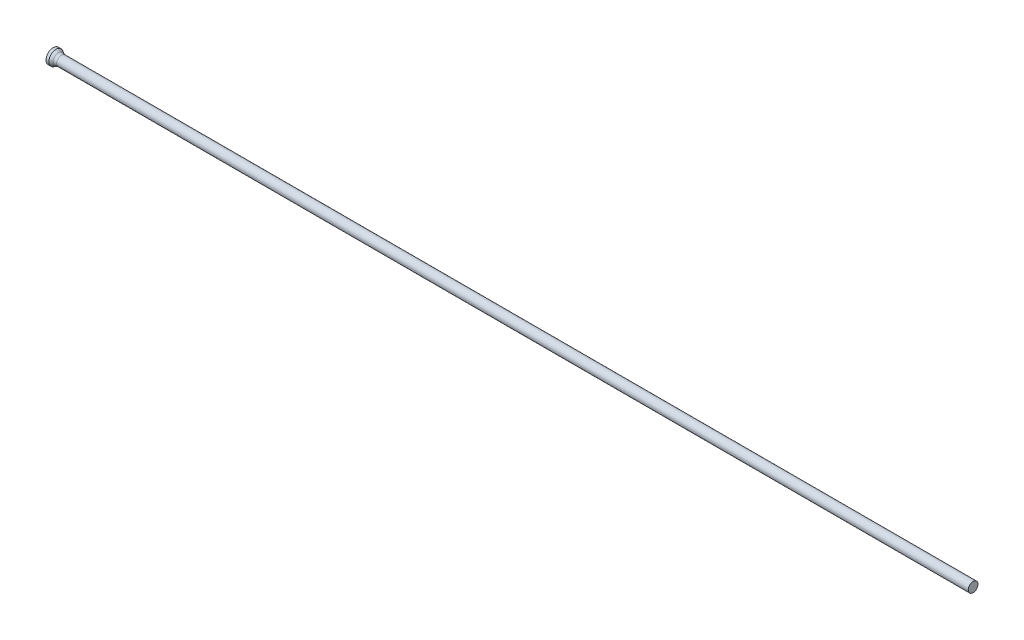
ISO-10303-21;
HEADER;
FILE_DESCRIPTION(('STEP AP214'),'2;1');
FILE_NAME('part.step','',(''),(''),'','','');
FILE_SCHEMA(('AUTOMOTIVE_DESIGN { 1 0 10303 214 1 1 1 1 }'));
ENDSEC;
DATA;
#1=APPLICATION_CONTEXT('core data for automotive mechanical design processes');
#2=APPLICATION_PROTOCOL_DEFINITION('international standard','automotive_design',2000,#1);
#3=PRODUCT_CONTEXT('',#1,'mechanical');
#4=PRODUCT('Part','Part','',(#3));
#5=PRODUCT_RELATED_PRODUCT_CATEGORY('part','',(#4));
#6=PRODUCT_DEFINITION_FORMATION('','',#4);
#7=PRODUCT_DEFINITION_CONTEXT('part definition',#1,'design');
#8=PRODUCT_DEFINITION('design','',#6,#7);
#9=PRODUCT_DEFINITION_SHAPE('','',#8);
#10=(LENGTH_UNIT() NAMED_UNIT(*) SI_UNIT(.MILLI.,.METRE.));
#11=(NAMED_UNIT(*) PLANE_ANGLE_UNIT() SI_UNIT($,.RADIAN.));
#12=(NAMED_UNIT(*) SI_UNIT($,.STERADIAN.) SOLID_ANGLE_UNIT());
#13=UNCERTAINTY_MEASURE_WITH_UNIT(LENGTH_MEASURE(1.E-05),#10,'distance_accuracy_value','');
#14=(GEOMETRIC_REPRESENTATION_CONTEXT(3) GLOBAL_UNCERTAINTY_ASSIGNED_CONTEXT((#13)) GLOBAL_UNIT_ASSIGNED_CONTEXT((#10,
#11,#12)) REPRESENTATION_CONTEXT('',''));
#15=CARTESIAN_POINT('',(0.,0.,0.));
#16=DIRECTION('',(0.,0.,1.));
#17=DIRECTION('',(1.,0.,0.));
#18=AXIS2_PLACEMENT_3D('',#15,#16,#17);
#19=CARTESIAN_POINT('',(0.,0.,0.));
#20=DIRECTION('',(1.,0.,0.));
#21=DIRECTION('',(0.,0.,-1.));
#22=AXIS2_PLACEMENT_3D('',#19,#20,#21);
#23=PLANE('',#22);
#24=CARTESIAN_POINT('',(0.,0.,0.));
#25=DIRECTION('',(-1.,0.,0.));
#26=DIRECTION('',(0.,0.,1.));
#27=AXIS2_PLACEMENT_3D('',#24,#25,#26);
#28=CIRCLE('',#27,1.25);
#29=CARTESIAN_POINT('',(0.,0.,1.25));
#30=VERTEX_POINT('',#29);
#31=EDGE_CURVE('E25',#30,#30,#28,.T.);
#32=ORIENTED_EDGE('',*,*,#31,.T.);
#33=EDGE_LOOP('',(#32));
#34=FACE_BOUND('',#33,.T.);
#35=ADVANCED_FACE('F14',(#34),#23,.F.);
#36=CARTESIAN_POINT('',(0.,0.,0.));
#37=DIRECTION('',(-1.,0.,0.));
#38=DIRECTION('',(0.,0.,1.));
#39=AXIS2_PLACEMENT_3D('',#36,#37,#38);
#40=CYLINDRICAL_SURFACE('',#39,1.25);
#41=ORIENTED_EDGE('',*,*,#31,.F.);
#42=EDGE_LOOP('',(#41));
#43=FACE_BOUND('',#42,.T.);
#44=CARTESIAN_POINT('',(0.497179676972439,0.,0.));
#45=DIRECTION('',(-1.,0.,0.));
#46=DIRECTION('',(0.,0.,1.));
#47=AXIS2_PLACEMENT_3D('',#44,#45,#46);
#48=CIRCLE('',#47,1.25);
#49=CARTESIAN_POINT('',(0.497179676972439,0.,1.25));
#50=VERTEX_POINT('',#49);
#51=EDGE_CURVE('E29',#50,#50,#48,.T.);
#52=ORIENTED_EDGE('',*,*,#51,.T.);
#53=EDGE_LOOP('',(#52));
#54=FACE_BOUND('',#53,.T.);
#55=ADVANCED_FACE('F53',(#43,#54),#40,.T.);
#56=CARTESIAN_POINT('',(1.19,0.,0.));
#57=DIRECTION('',(-1.,0.,0.));
#58=DIRECTION('',(0.,0.,1.));
#59=AXIS2_PLACEMENT_3D('',#56,#57,#58);
#60=CONICAL_SURFACE('',#59,0.85,0.523598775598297);
#61=CARTESIAN_POINT('',(0.957949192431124,0.,0.));
#62=DIRECTION('',(-1.,0.,0.));
#63=DIRECTION('',(0.,0.,1.));
#64=AXIS2_PLACEMENT_3D('',#61,#62,#63);
#65=CIRCLE('',#64,0.983974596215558);
#66=CARTESIAN_POINT('',(0.957949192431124,0.,0.983974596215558));
#67=VERTEX_POINT('',#66);
#68=EDGE_CURVE('E21',#67,#67,#65,.T.);
#69=ORIENTED_EDGE('',*,*,#68,.T.);
#70=EDGE_LOOP('',(#69));
#71=FACE_BOUND('',#70,.T.);
#72=ORIENTED_EDGE('',*,*,#51,.F.);
#73=EDGE_LOOP('',(#72));
#74=FACE_BOUND('',#73,.T.);
#75=ADVANCED_FACE('F50',(#71,#74),#60,.T.);
#76=CARTESIAN_POINT('',(0.,0.,0.));
#77=DIRECTION('',(-1.,0.,0.));
#78=DIRECTION('',(0.,0.,1.));
#79=AXIS2_PLACEMENT_3D('',#76,#77,#78);
#80=CYLINDRICAL_SURFACE('',#79,0.85);
#81=CARTESIAN_POINT('',(1.45794919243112,0.,0.));
#82=DIRECTION('',(-1.,0.,0.));
#83=DIRECTION('',(0.,0.,1.));
#84=AXIS2_PLACEMENT_3D('',#81,#82,#83);
#85=CIRCLE('',#84,0.85);
#86=CARTESIAN_POINT('',(1.45794919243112,0.,0.85));
#87=VERTEX_POINT('',#86);
#88=EDGE_CURVE('E9',#87,#87,#85,.F.);
#89=ORIENTED_EDGE('',*,*,#88,.T.);
#90=EDGE_LOOP('',(#89));
#91=FACE_BOUND('',#90,.T.);
#92=CARTESIAN_POINT('',(160.,0.,0.));
#93=DIRECTION('',(-1.,0.,0.));
#94=DIRECTION('',(0.,0.,1.));
#95=AXIS2_PLACEMENT_3D('',#92,#93,#94);
#96=CIRCLE('',#95,0.85);
#97=CARTESIAN_POINT('',(160.,0.,0.85));
#98=VERTEX_POINT('',#97);
#99=EDGE_CURVE('E34',#98,#98,#96,.T.);
#100=ORIENTED_EDGE('',*,*,#99,.T.);
#101=EDGE_LOOP('',(#100));
#102=FACE_BOUND('',#101,.T.);
#103=ADVANCED_FACE('F38',(#91,#102),#80,.T.);
#104=CARTESIAN_POINT('',(160.,0.85,0.));
#105=DIRECTION('',(-1.,0.,0.));
#106=DIRECTION('',(0.,0.,1.));
#107=AXIS2_PLACEMENT_3D('',#104,#105,#106);
#108=PLANE('',#107);
#109=ORIENTED_EDGE('',*,*,#99,.F.);
#110=EDGE_LOOP('',(#109));
#111=FACE_BOUND('',#110,.T.);
#112=ADVANCED_FACE('F40',(#111),#108,.F.);
#113=CARTESIAN_POINT('',(1.45794919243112,0.,0.));
#114=DIRECTION('',(-1.,0.,0.));
#115=DIRECTION('',(0.,0.,1.));
#116=AXIS2_PLACEMENT_3D('',#113,#114,#115);
#117=TOROIDAL_SURFACE('',#116,1.85,1.);
#118=ORIENTED_EDGE('',*,*,#88,.F.);
#119=EDGE_LOOP('',(#118));
#120=FACE_BOUND('',#119,.T.);
#121=ORIENTED_EDGE('',*,*,#68,.F.);
#122=EDGE_LOOP('',(#121));
#123=FACE_BOUND('',#122,.T.);
#124=ADVANCED_FACE('F16',(#120,#123),#117,.F.);
#125=CLOSED_SHELL('',(#35,#55,#75,#103,#112,#124));
#126=MANIFOLD_SOLID_BREP('B1',#125);
#127=ADVANCED_BREP_SHAPE_REPRESENTATION('',(#18,#126),#14);
#128=SHAPE_DEFINITION_REPRESENTATION(#9,#127);
ENDSEC;
END-ISO-10303-21;
